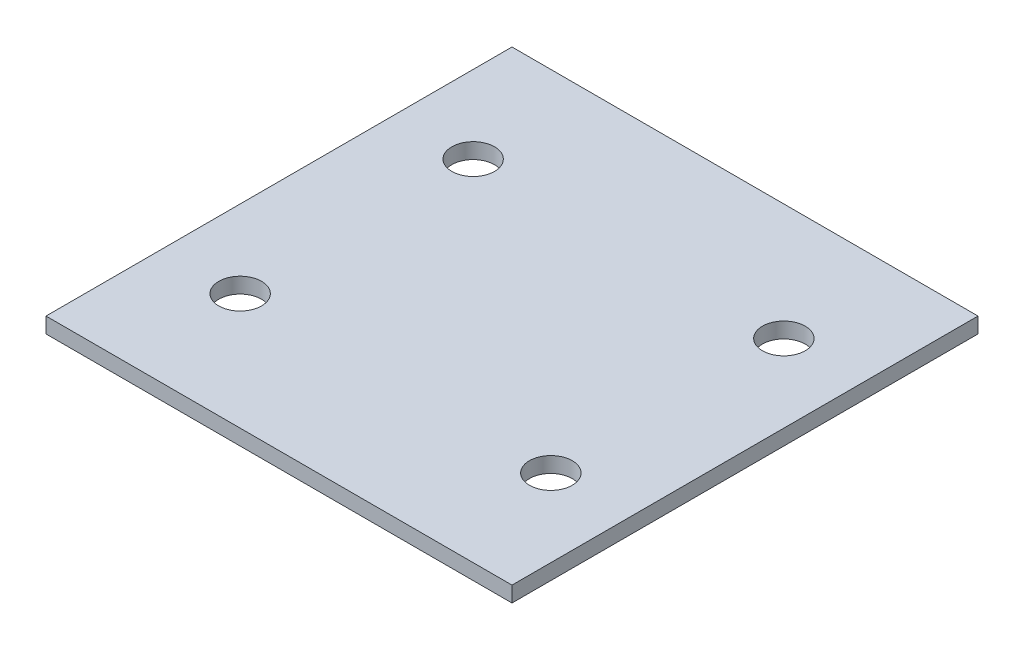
from build123d import *

# Parameters (mm, degrees)
SKETCH_1_W                   = 120
SKETCH_1_H                   = 120
SKETCH_1_R                   = 5.5
EXTRUDE_120_120_4_4_11_DEPTH = 4


with BuildPart() as part:
    # Sketch 1 → Extrude 120_120_4_ 4 _. _11 (new body)
    with BuildSketch(Plane(origin=(0, 0, 0), x_dir=(1, 0, 0), z_dir=(0, 1, 0))):
        Rectangle(SKETCH_1_W, SKETCH_1_H)
        with Locations(Location((-40, -30, 0), (0, 0, 270))):
            Circle(SKETCH_1_R, mode=Mode.SUBTRACT)
        with Locations(Location((-40, 30, 0), (0, 0, 270))):
            Circle(SKETCH_1_R, mode=Mode.SUBTRACT)
        with Locations(Location((40, -30, 0), (0, 0, 270))):
            Circle(SKETCH_1_R, mode=Mode.SUBTRACT)
        with Locations(Location((40, 30, 0), (0, 0, 270))):
            Circle(SKETCH_1_R, mode=Mode.SUBTRACT)
    extrude(amount=EXTRUDE_120_120_4_4_11_DEPTH)


solid = part.part
